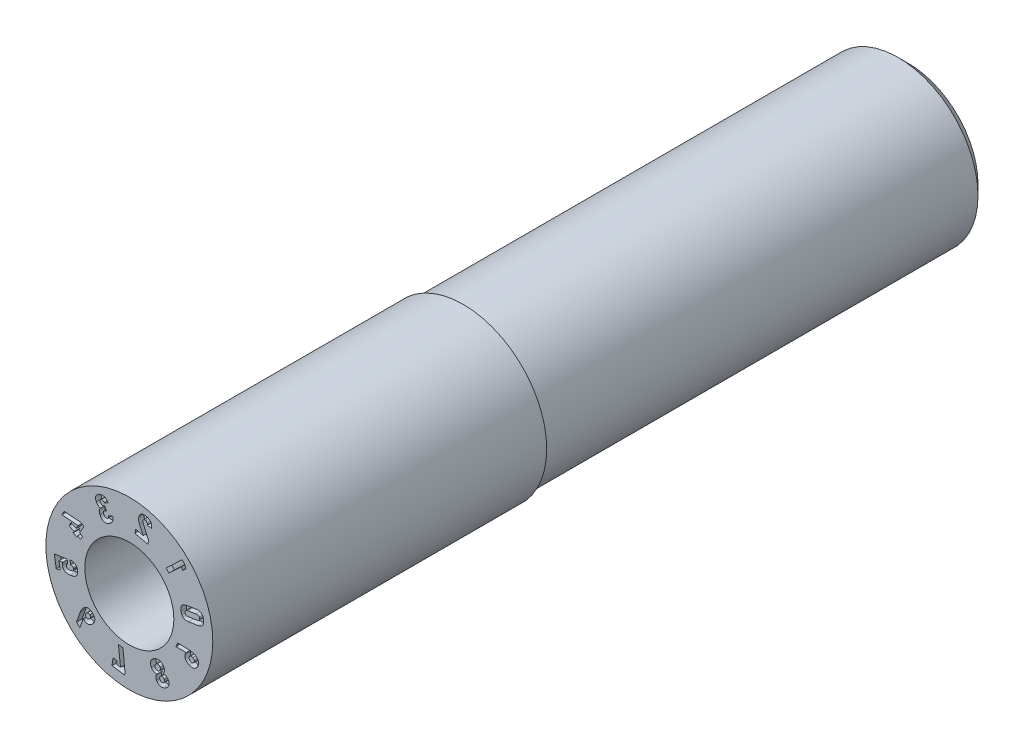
from build123d import *

# Parameters (mm, degrees)
SKETCH5_W          = 8
SKETCH5_H          = 1
CUT_EXTRUDE1_DEPTH = 0.1
CUT_EXTRUDE2_DEPTH = 1.4


with BuildPart() as part:
    # Sketch1 → Revolve1 (revolve)
    with BuildSketch(Plane(origin=(0, 0, 0), x_dir=(0, 0, -1), z_dir=(1, 0, 0)), mode=Mode.PRIVATE) as revolve1_sk:
        Polygon((0, 1.5), (0, 0.8), (2.2, 0.8), (2.2, 0.6), (11, 0.6), (11, 1), (14, 1), (14, 1.25), (13.75, 1.5), align=None)
    revolve(revolve1_sk.sketch.rotate(Axis((0, 0, 3.797909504), (0, 0, -1)), 90), axis=Axis((0, 0, 3.797909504), (0, 0, -1)))

    # Sketch5 → Cut-Revolve1 (revolve, cut)
    with BuildSketch(Plane(origin=(0, 0, 0), x_dir=(0, 0, -1), z_dir=(1, 0, 0)), mode=Mode.PRIVATE) as cut_revolve1_sk:
        with Locations((10, 1.935)):
            Rectangle(SKETCH5_W, SKETCH5_H)
    revolve(cut_revolve1_sk.sketch.rotate(Axis((0, 0, 0), (0, 0, -1)), 90), axis=Axis((0, 0, 0), (0, 0, -1)), mode=Mode.SUBTRACT)

    # Sketch2 → Cut-Extrude1 (cut)
    # profile 1 of 10: a face of its own
    with BuildSketch(Plane.XY):
        with BuildLine():
            Line((1.061105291, 0.091332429), (1.241310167, 0.120839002))
            add(Edge.make_bspline(
                [(1.241310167, 0.120839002), (1.249712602, 0.122329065), (1.261990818, 0.12503299), (1.277231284, 0.130894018), (1.287487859, 0.136007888), (1.296895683, 0.141888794), (1.305281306, 0.148745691), (1.312845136, 0.156329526), (1.319423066, 0.164756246), (1.325094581, 0.173946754), (1.329639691, 0.183906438), (1.333244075, 0.19451498), (1.33560567, 0.205869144), (1.33693586, 0.217888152), (1.337424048, 0.235376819), (1.335985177, 0.24880406), (1.334501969, 0.257897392)],
                knots=[0, 0, 0, 0, 0.135830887, 0.19894994, 0.259122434, 0.3177924, 0.374921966, 0.430943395, 0.487732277, 0.544476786, 0.602225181, 0.661404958, 0.72222515, 0.786185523, 0.85342678, 1, 1, 1, 1], degree=3))
            add(Edge.make_bspline(
                [(1.334501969, 0.257897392), (1.333078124, 0.267022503), (1.329955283, 0.280169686), (1.324067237, 0.296681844), (1.319025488, 0.307732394), (1.313005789, 0.317662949), (1.306406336, 0.326705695), (1.298850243, 0.334596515), (1.290629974, 0.341514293), (1.281752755, 0.347434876), (1.272130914, 0.352107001), (1.261996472, 0.355886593), (1.251203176, 0.358403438), (1.239856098, 0.360064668), (1.223455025, 0.360516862), (1.210887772, 0.359517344), (1.202412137, 0.358020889)],
                knots=[0, 0, 0, 0, 0.14661834, 0.213950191, 0.278189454, 0.339132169, 0.398086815, 0.455623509, 0.512166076, 0.568446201, 0.624592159, 0.681675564, 0.739860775, 0.800266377, 0.863502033, 1, 1, 1, 1], degree=3))
            Line((1.202412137, 0.358020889), (1.02220726, 0.328514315))
            add(Edge.make_bspline(
                [(1.02220726, 0.328514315), (1.013806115, 0.327021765), (1.001524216, 0.324324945), (0.986264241, 0.318443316), (0.975993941, 0.313354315), (0.966601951, 0.307444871), (0.958226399, 0.300583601), (0.950601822, 0.293025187), (0.944018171, 0.284569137), (0.938349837, 0.275379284), (0.93378897, 0.265442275), (0.930270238, 0.254795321), (0.927956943, 0.243428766), (0.926579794, 0.23139828), (0.92627547, 0.213913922), (0.927593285, 0.200499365), (0.929118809, 0.191404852)],
                knots=[0, 0, 0, 0, 0.135782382, 0.198878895, 0.259457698, 0.317687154, 0.374796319, 0.431184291, 0.487952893, 0.544677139, 0.602404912, 0.661302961, 0.722472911, 0.786410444, 0.853479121, 1, 1, 1, 1], degree=3))
            add(Edge.make_bspline(
                [(0.929118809, 0.191404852), (0.930653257, 0.182308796), (0.933505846, 0.169084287), (0.939548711, 0.152610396), (0.944717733, 0.141632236), (0.950575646, 0.131598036), (0.95730495, 0.122623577), (0.964929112, 0.114761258), (0.973221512, 0.107823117), (0.982275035, 0.10206596), (0.99184352, 0.097204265), (1.002059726, 0.09359919), (1.012790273, 0.090892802), (1.024119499, 0.089432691), (1.04032889, 0.08876663), (1.05273824, 0.089975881), (1.061105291, 0.091332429)],
                knots=[0, 0, 0, 0, 0.146857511, 0.214297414, 0.2786784, 0.339619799, 0.398794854, 0.456598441, 0.513449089, 0.570345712, 0.6268801, 0.683776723, 0.742278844, 0.802579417, 0.865100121, 1, 1, 1, 1], degree=3))
        make_face()
        with BuildLine():
            Line((1.053578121, 0.256946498), (1.19560905, 0.280242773))
            add(Edge.make_bspline(
                [(1.19560905, 0.280242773), (1.204155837, 0.28164808), (1.216530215, 0.282603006), (1.2320395, 0.280524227), (1.240103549, 0.277751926), (1.245724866, 0.274766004), (1.249446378, 0.272026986), (1.25266463, 0.268768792), (1.255612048, 0.265177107), (1.257860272, 0.260981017), (1.260795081, 0.254815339), (1.261815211, 0.249600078), (1.262507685, 0.246090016)],
                knots=[0, 0, 0, 0, 0.304004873, 0.431403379, 0.54612764, 0.60073158, 0.654116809, 0.707374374, 0.761014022, 0.816319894, 0.87376701, 1, 1, 1, 1], degree=3))
            add(Edge.make_bspline(
                [(1.262507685, 0.246090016), (1.263038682, 0.24257159), (1.263578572, 0.237314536), (1.262894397, 0.230529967), (1.262015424, 0.225834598), (1.26043404, 0.221496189), (1.258305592, 0.21746932), (1.255668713, 0.213719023), (1.251398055, 0.208991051), (1.244607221, 0.203810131), (1.230629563, 0.196786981), (1.218578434, 0.193739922), (1.210016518, 0.192432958)],
                knots=[0, 0, 0, 0, 0.125282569, 0.183772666, 0.238900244, 0.292522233, 0.345142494, 0.398364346, 0.453019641, 0.568244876, 0.695575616, 1, 1, 1, 1], degree=3))
            Line((1.210016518, 0.192432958), (1.067985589, 0.169136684))
            add(Edge.make_bspline(
                [(1.067985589, 0.169136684), (1.059415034, 0.167701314), (1.047014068, 0.166755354), (1.031460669, 0.168821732), (1.023401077, 0.171632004), (1.017834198, 0.174713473), (1.014150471, 0.177421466), (1.010897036, 0.180615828), (1.008012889, 0.184226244), (1.005608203, 0.188338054), (1.002904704, 0.194586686), (1.001736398, 0.199701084), (1.001113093, 0.203212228)],
                knots=[0, 0, 0, 0, 0.305186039, 0.43268909, 0.548095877, 0.602100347, 0.655529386, 0.707979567, 0.761663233, 0.817203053, 0.874610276, 1, 1, 1, 1], degree=3))
            add(Edge.make_bspline(
                [(1.001113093, 0.203212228), (1.000576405, 0.206752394), (0.999982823, 0.212016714), (1.000739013, 0.218795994), (1.001614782, 0.22348779), (1.003173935, 0.227849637), (1.005152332, 0.231979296), (1.007831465, 0.235707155), (1.01208896, 0.240439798), (1.018870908, 0.245640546), (1.032955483, 0.252499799), (1.044966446, 0.255680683), (1.053578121, 0.256946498)],
                knots=[0, 0, 0, 0, 0.126012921, 0.18354079, 0.238579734, 0.292863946, 0.345382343, 0.398518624, 0.453086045, 0.568126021, 0.695112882, 1, 1, 1, 1], degree=3))
        make_face(mode=Mode.SUBTRACT)
    # profile 2 of 10: a face of its own
    with BuildSketch(Plane.XY):
        Polygon((0.660301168, 0.727846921), (0.711724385, 0.673304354), (0.936972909, 0.885696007), (0.956782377, 0.838023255), (1.014689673, 0.892601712), (0.993469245, 0.954153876), (0.949588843, 1.000671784), align=None)
    # profile 3 of 10: a face of its own
    with BuildSketch(Plane.XY):
        with BuildLine():
            Line((0.345813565, 0.998950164), (0.253704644, 1.205895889))
            add(Edge.make_bspline(
                [(0.253704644, 1.205895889), (0.249756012, 1.214591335), (0.246068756, 1.226001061), (0.244672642, 1.239840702), (0.244243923, 1.24800905), (0.245135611, 1.253934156), (0.245888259, 1.257685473)],
                knots=[0, 0, 0, 0, 0.539847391, 0.665182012, 0.783746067, 1, 1, 1, 1], degree=3))
            add(Edge.make_bspline(
                [(0.245888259, 1.257685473), (0.247213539, 1.262849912), (0.249676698, 1.269823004), (0.256251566, 1.276593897), (0.261908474, 1.280382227), (0.268556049, 1.282767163), (0.27898945, 1.284480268), (0.287251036, 1.282983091), (0.292801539, 1.281861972)],
                knots=[0, 0, 0, 0, 0.246554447, 0.358339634, 0.470643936, 0.586937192, 0.711616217, 1, 1, 1, 1], degree=3))
            add(Edge.make_bspline(
                [(0.292801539, 1.281861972), (0.298416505, 1.280624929), (0.306338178, 1.277254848), (0.314903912, 1.269924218), (0.319690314, 1.263094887), (0.323238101, 1.255250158), (0.326165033, 1.242834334), (0.326041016, 1.232860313), (0.325122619, 1.226067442)],
                knots=[0, 0, 0, 0, 0.240641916, 0.353618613, 0.468242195, 0.587235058, 0.712493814, 1, 1, 1, 1], degree=3))
            Line((0.325122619, 1.226067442), (0.400214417, 1.208076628))
            add(Edge.make_bspline(
                [(0.400214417, 1.208076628), (0.402182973, 1.219927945), (0.403512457, 1.237158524), (0.401431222, 1.259553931), (0.397813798, 1.274920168), (0.392614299, 1.289294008), (0.38547612, 1.302404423), (0.376737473, 1.314303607), (0.36629261, 1.324876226), (0.354347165, 1.33415127), (0.335942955, 1.344543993), (0.32069766, 1.349934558), (0.310034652, 1.352322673)],
                knots=[0, 0, 0, 0, 0.185769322, 0.271412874, 0.354359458, 0.434537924, 0.512194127, 0.589378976, 0.667037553, 0.74626446, 0.827541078, 1, 1, 1, 1], degree=3))
            add(Edge.make_bspline(
                [(0.310034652, 1.352322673), (0.298767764, 1.355023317), (0.282009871, 1.357701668), (0.260116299, 1.357402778), (0.245219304, 1.355461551), (0.231405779, 1.351742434), (0.218764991, 1.346229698), (0.207313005, 1.339000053), (0.197223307, 1.329908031), (0.18843772, 1.319246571), (0.178362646, 1.30242038), (0.173478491, 1.288120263), (0.17112035, 1.278155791)],
                knots=[0, 0, 0, 0, 0.194556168, 0.282839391, 0.366540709, 0.445965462, 0.522017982, 0.597070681, 0.672156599, 0.74889867, 0.828020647, 1, 1, 1, 1], degree=3))
            add(Edge.make_bspline(
                [(0.17112035, 1.278155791), (0.168994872, 1.268991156), (0.166958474, 1.255425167), (0.166752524, 1.237062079), (0.167648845, 1.223122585), (0.169805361, 1.209272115), (0.173826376, 1.19118304), (0.178710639, 1.178173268), (0.182568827, 1.169830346)],
                knots=[0, 0, 0, 0, 0.246193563, 0.370512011, 0.497719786, 0.624739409, 0.750481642, 1, 1, 1, 1], degree=3))
            Line((0.182568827, 1.169830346), (0.249853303, 1.026420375))
            Line((0.249853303, 1.026420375), (0.116920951, 1.057728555))
            Line((0.116920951, 1.057728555), (0.100271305, 0.987159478))
            Line((0.100271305, 0.987159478), (0.330249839, 0.932939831))
            Line((0.330249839, 0.932939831), (0.345813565, 0.998950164))
        make_face()
    # profile 4 of 10: a face of its own
    with BuildSketch(Plane.XY):
        with BuildLine():
            Line((-0.30079773, 1.056129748), (-0.372170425, 1.025177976))
            add(Edge.make_bspline(
                [(-0.372170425, 1.025177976), (-0.371130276, 1.021378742), (-0.37001851, 1.015691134), (-0.369931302, 1.008181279), (-0.370410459, 1.002947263), (-0.37157798, 0.997985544), (-0.37331833, 0.993348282), (-0.375655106, 0.98903646), (-0.378495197, 0.985022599), (-0.381924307, 0.981361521), (-0.387322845, 0.97690902), (-0.392019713, 0.974319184), (-0.395340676, 0.972875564)],
                knots=[0, 0, 0, 0, 0.187325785, 0.273109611, 0.355951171, 0.436293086, 0.514407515, 0.59045926, 0.668563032, 0.747271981, 0.827934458, 1, 1, 1, 1], degree=3))
            add(Edge.make_bspline(
                [(-0.395340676, 0.972875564), (-0.401251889, 0.970350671), (-0.410351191, 0.967613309), (-0.422498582, 0.968024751), (-0.43064163, 0.970266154), (-0.43806197, 0.97439101), (-0.447211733, 0.982555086), (-0.452090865, 0.990814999), (-0.454647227, 0.99678484)],
                knots=[0, 0, 0, 0, 0.26670514, 0.383629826, 0.497523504, 0.612061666, 0.731013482, 1, 1, 1, 1], degree=3))
            Line((-0.454647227, 0.99678484), (-0.458345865, 1.00536625))
            add(Edge.make_bspline(
                [(-0.458345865, 1.00536625), (-0.461094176, 1.011585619), (-0.464129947, 1.02091581), (-0.465031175, 1.033335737), (-0.463955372, 1.041397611), (-0.461287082, 1.048655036), (-0.455327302, 1.057176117), (-0.448640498, 1.061620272), (-0.443745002, 1.06365982)],
                knots=[0, 0, 0, 0, 0.300448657, 0.427636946, 0.54636436, 0.656555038, 0.76555918, 1, 1, 1, 1], degree=3))
            Line((-0.443745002, 1.06365982), (-0.412776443, 1.077127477))
            Line((-0.412776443, 1.077127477), (-0.441658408, 1.143669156))
            Line((-0.441658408, 1.143669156), (-0.472626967, 1.130201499))
            add(Edge.make_bspline(
                [(-0.472626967, 1.130201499), (-0.476613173, 1.128453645), (-0.483084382, 1.126954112), (-0.491623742, 1.128451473), (-0.497546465, 1.131247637), (-0.503107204, 1.135486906), (-0.510272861, 1.143390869), (-0.514269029, 1.150806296), (-0.516546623, 1.156140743)],
                knots=[0, 0, 0, 0, 0.227938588, 0.33443529, 0.446444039, 0.566137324, 0.696860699, 1, 1, 1, 1], degree=3))
            Line((-0.516546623, 1.156140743), (-0.519303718, 1.162505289))
            add(Edge.make_bspline(
                [(-0.519303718, 1.162505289), (-0.5215372, 1.167515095), (-0.523942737, 1.175124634), (-0.524206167, 1.185276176), (-0.522956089, 1.191966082), (-0.52027999, 1.198018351), (-0.514755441, 1.205310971), (-0.508644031, 1.208957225), (-0.504361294, 1.210890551)],
                knots=[0, 0, 0, 0, 0.287321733, 0.409765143, 0.527101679, 0.639753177, 0.752440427, 1, 1, 1, 1], degree=3))
            add(Edge.make_bspline(
                [(-0.504361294, 1.210890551), (-0.501348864, 1.212169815), (-0.496635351, 1.213564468), (-0.490130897, 1.214052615), (-0.485268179, 1.213601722), (-0.480381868, 1.212552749), (-0.475552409, 1.210814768), (-0.470789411, 1.208366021), (-0.466070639, 1.205341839), (-0.461605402, 1.201508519), (-0.455517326, 1.195614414), (-0.451688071, 1.190298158), (-0.449194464, 1.186607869)],
                knots=[0, 0, 0, 0, 0.149128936, 0.221829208, 0.295876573, 0.370818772, 0.449003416, 0.528923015, 0.614401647, 0.703668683, 0.796545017, 1, 1, 1, 1], degree=3))
            Line((-0.449194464, 1.186607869), (-0.378107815, 1.217492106))
            add(Edge.make_bspline(
                [(-0.378107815, 1.217492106), (-0.383573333, 1.227699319), (-0.393151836, 1.241826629), (-0.408552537, 1.257887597), (-0.420900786, 1.267693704), (-0.433966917, 1.275711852), (-0.447668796, 1.281739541), (-0.461853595, 1.285924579), (-0.476522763, 1.287872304), (-0.491427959, 1.288086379), (-0.511697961, 1.2856743), (-0.526537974, 1.281167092), (-0.536052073, 1.27693168)],
                knots=[0, 0, 0, 0, 0.185488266, 0.271824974, 0.355693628, 0.437514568, 0.516845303, 0.594943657, 0.673717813, 0.753251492, 0.833268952, 1, 1, 1, 1], degree=3))
            add(Edge.make_bspline(
                [(-0.536052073, 1.27693168), (-0.543699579, 1.273528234), (-0.554684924, 1.268081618), (-0.567961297, 1.259236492), (-0.576488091, 1.252173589), (-0.584175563, 1.244793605), (-0.59069725, 1.236819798), (-0.596230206, 1.228376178), (-0.600740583, 1.219510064), (-0.604103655, 1.210221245), (-0.606480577, 1.200636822), (-0.607610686, 1.190733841), (-0.607658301, 1.180541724), (-0.606581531, 1.170066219), (-0.603586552, 1.155352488), (-0.59974615, 1.14447066), (-0.59658399, 1.137290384)],
                knots=[0, 0, 0, 0, 0.145099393, 0.211783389, 0.275893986, 0.336683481, 0.396114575, 0.453924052, 0.511277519, 0.568019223, 0.624714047, 0.681957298, 0.740253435, 0.800964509, 0.8640578, 1, 1, 1, 1], degree=3))
            Line((-0.59658399, 1.137290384), (-0.591761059, 1.126210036))
            add(Edge.make_bspline(
                [(-0.591761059, 1.126210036), (-0.588275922, 1.118204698), (-0.581741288, 1.106844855), (-0.56973817, 1.094648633), (-0.559797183, 1.087115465), (-0.548765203, 1.081297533), (-0.532538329, 1.075892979), (-0.519561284, 1.074544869), (-0.510806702, 1.074959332)],
                knots=[0, 0, 0, 0, 0.256823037, 0.378945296, 0.500019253, 0.621491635, 0.743175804, 1, 1, 1, 1], degree=3))
            add(Edge.make_bspline(
                [(-0.510806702, 1.074959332), (-0.514642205, 1.072113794), (-0.520103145, 1.067542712), (-0.526088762, 1.060382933), (-0.530049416, 1.054884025), (-0.533369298, 1.04899411), (-0.536199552, 1.042808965), (-0.538227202, 1.036220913), (-0.539796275, 1.029425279), (-0.54078901, 1.022367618), (-0.541052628, 1.015099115), (-0.540915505, 1.007620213), (-0.539953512, 1.000002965), (-0.538505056, 0.992195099), (-0.535443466, 0.981392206), (-0.532546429, 0.973295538), (-0.530187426, 0.967938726)],
                knots=[0, 0, 0, 0, 0.121200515, 0.179079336, 0.236021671, 0.292613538, 0.350073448, 0.407952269, 0.466857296, 0.526624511, 0.588137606, 0.650919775, 0.715867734, 0.78235817, 0.851885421, 1, 1, 1, 1], degree=3))
            Line((-0.530187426, 0.967938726), (-0.525420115, 0.956798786))
            add(Edge.make_bspline(
                [(-0.525420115, 0.956798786), (-0.521083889, 0.946850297), (-0.513481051, 0.932769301), (-0.500085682, 0.916991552), (-0.489339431, 0.907340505), (-0.477586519, 0.899632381), (-0.464944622, 0.893838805), (-0.451345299, 0.890319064), (-0.437027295, 0.888587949), (-0.421960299, 0.888997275), (-0.400377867, 0.892378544), (-0.384356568, 0.89785049), (-0.373764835, 0.902448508)],
                knots=[0, 0, 0, 0, 0.17807367, 0.259615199, 0.337969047, 0.413847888, 0.489006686, 0.564669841, 0.643008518, 0.724525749, 0.81071921, 1, 1, 1, 1], degree=3))
            add(Edge.make_bspline(
                [(-0.373764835, 0.902448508), (-0.363190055, 0.90696375), (-0.348311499, 0.915164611), (-0.330871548, 0.928861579), (-0.319668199, 0.939968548), (-0.310219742, 0.952077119), (-0.302669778, 0.965105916), (-0.297037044, 0.978962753), (-0.293396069, 0.99356865), (-0.291703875, 1.008765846), (-0.292818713, 1.030053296), (-0.296801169, 1.0458668), (-0.30079773, 1.056129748)],
                knots=[0, 0, 0, 0, 0.181387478, 0.266397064, 0.349196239, 0.429699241, 0.508011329, 0.586041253, 0.664911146, 0.744826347, 0.826380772, 1, 1, 1, 1], degree=3))
        make_face()
    # profile 5 of 10: a face of its own
    with BuildSketch(Plane.XY):
        Polygon((-0.876360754, 0.671912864), (-1.170315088, 0.694570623), (-1.211535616, 0.620249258), (-0.922120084, 0.596399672), (-0.957342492, 0.532918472), (-1.045539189, 0.581823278), (-1.081963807, 0.516150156), (-0.993777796, 0.467251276), (-1.008923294, 0.439954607), (-0.945606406, 0.404848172), (-0.930460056, 0.432141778), (-0.876762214, 0.402366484), (-0.840337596, 0.468039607), (-0.894020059, 0.497806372), (-0.815978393, 0.638436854), align=None)
    # profile 6 of 10: a face of its own
    with BuildSketch(Plane.XY):
        with BuildLine():
            Line((-1.065974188, -0.006087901), (-1.05494176, -0.0807829))
            add(Edge.make_bspline(
                [(-1.05494176, -0.0807829), (-1.047918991, -0.080465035), (-1.03810682, -0.080939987), (-1.026101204, -0.084664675), (-1.018563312, -0.088720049), (-1.012247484, -0.093970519), (-1.005410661, -0.102691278), (-1.002920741, -0.110834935), (-1.002068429, -0.116362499)],
                knots=[0, 0, 0, 0, 0.285793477, 0.412921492, 0.53239847, 0.647955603, 0.760370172, 1, 1, 1, 1], degree=3))
            add(Edge.make_bspline(
                [(-1.002068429, -0.116362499), (-1.001144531, -0.122240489), (-1.001102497, -0.131233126), (-1.005374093, -0.142000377), (-1.010211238, -0.148860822), (-1.016607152, -0.154787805), (-1.027997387, -0.161199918), (-1.037889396, -0.163884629), (-1.044912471, -0.164843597)],
                knots=[0, 0, 0, 0, 0.244925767, 0.356384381, 0.468896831, 0.585751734, 0.710067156, 1, 1, 1, 1], degree=3))
            Line((-1.044912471, -0.164843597), (-1.078165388, -0.169934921))
            add(Edge.make_bspline(
                [(-1.078165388, -0.169934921), (-1.085135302, -0.171091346), (-1.095317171, -0.171569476), (-1.108035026, -0.169270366), (-1.115821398, -0.166069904), (-1.12238343, -0.161625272), (-1.12914265, -0.153497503), (-1.131925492, -0.14590896), (-1.132600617, -0.140564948)],
                knots=[0, 0, 0, 0, 0.303139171, 0.433056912, 0.551453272, 0.662010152, 0.769650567, 1, 1, 1, 1], degree=3))
            add(Edge.make_bspline(
                [(-1.132600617, -0.140564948), (-1.13329294, -0.135553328), (-1.133675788, -0.127978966), (-1.131387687, -0.118400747), (-1.128795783, -0.111830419), (-1.1250072, -0.105899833), (-1.118531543, -0.098859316), (-1.112390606, -0.094888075), (-1.107972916, -0.092820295)],
                knots=[0, 0, 0, 0, 0.26314939, 0.385420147, 0.507310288, 0.627040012, 0.747387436, 1, 1, 1, 1], degree=3))
            Line((-1.107972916, -0.092820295), (-1.118583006, -0.023031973))
            Line((-1.118583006, -0.023031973), (-1.346539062, -0.05767993))
            Line((-1.346539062, -0.05767993), (-1.314208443, -0.27056081))
            Line((-1.314208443, -0.27056081), (-1.242222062, -0.259605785))
            Line((-1.242222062, -0.259605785), (-1.263184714, -0.121400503))
            Line((-1.263184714, -0.121400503), (-1.193162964, -0.110717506))
            add(Edge.make_bspline(
                [(-1.193162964, -0.110717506), (-1.19552954, -0.114165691), (-1.198495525, -0.120000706), (-1.201169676, -0.12857847), (-1.204304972, -0.143022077), (-1.204371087, -0.155660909), (-1.202945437, -0.165525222)],
                knots=[0, 0, 0, 0, 0.220510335, 0.343083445, 0.473505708, 1, 1, 1, 1], degree=3))
            add(Edge.make_bspline(
                [(-1.202945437, -0.165525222), (-1.201536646, -0.175151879), (-1.197736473, -0.189005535), (-1.189125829, -0.205634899), (-1.181013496, -0.216278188), (-1.171460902, -0.22551895), (-1.160362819, -0.233105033), (-1.147941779, -0.239249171), (-1.13404151, -0.243561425), (-1.118899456, -0.24650311), (-1.096245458, -0.247873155), (-1.078699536, -0.246639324), (-1.066773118, -0.244688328)],
                knots=[0, 0, 0, 0, 0.16345591, 0.239143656, 0.313391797, 0.387378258, 0.461556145, 0.538434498, 0.619394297, 0.705409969, 0.797083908, 1, 1, 1, 1], degree=3))
            Line((-1.066773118, -0.244688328), (-1.033520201, -0.239597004))
            add(Edge.make_bspline(
                [(-1.033520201, -0.239597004), (-1.021629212, -0.237682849), (-1.00433669, -0.233797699), (-0.983464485, -0.224439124), (-0.969924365, -0.216236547), (-0.958182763, -0.206585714), (-0.948212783, -0.195610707), (-0.940185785, -0.183255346), (-0.934051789, -0.169604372), (-0.92983302, -0.154776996), (-0.92694118, -0.132812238), (-0.92798305, -0.115725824), (-0.929775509, -0.104201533)],
                knots=[0, 0, 0, 0, 0.186829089, 0.271958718, 0.353046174, 0.4311405, 0.506366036, 0.581642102, 0.658195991, 0.737161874, 0.819375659, 1, 1, 1, 1], degree=3))
            add(Edge.make_bspline(
                [(-0.929775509, -0.104201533), (-0.931199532, -0.093987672), (-0.935271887, -0.079205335), (-0.944007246, -0.061018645), (-0.952215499, -0.048799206), (-0.961889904, -0.037806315), (-0.973073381, -0.02825315), (-0.985732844, -0.020306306), (-0.999677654, -0.013868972), (-1.014803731, -0.009065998), (-1.036984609, -0.005177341), (-1.05428196, -0.005037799), (-1.065974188, -0.006087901)],
                knots=[0, 0, 0, 0, 0.165214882, 0.244126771, 0.322749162, 0.400604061, 0.478371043, 0.557852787, 0.639634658, 0.724164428, 0.81171006, 1, 1, 1, 1], degree=3))
        make_face()
    # profile 7 of 10: a face of its own
    with BuildSketch(Plane.XY):
        with BuildLine():
            Line((-0.885086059, -0.73813894), (-0.947990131, -0.917865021))
            Line((-0.947990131, -0.917865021), (-0.887270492, -0.977544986))
            Line((-0.887270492, -0.977544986), (-0.828853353, -0.805452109))
            add(Edge.make_bspline(
                [(-0.828853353, -0.805452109), (-0.826109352, -0.809529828), (-0.822899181, -0.813294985), (-0.819389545, -0.81672828)],
                knots=[0.757127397, 0.757127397, 0.757127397, 0.757127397, 1, 1, 1, 1], degree=3))
            add(Edge.make_bspline(
                [(-0.819389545, -0.81672828), (-0.812103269, -0.823996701), (-0.80025814, -0.833469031), (-0.782687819, -0.842267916), (-0.769544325, -0.846602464), (-0.756102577, -0.84875298), (-0.74248347, -0.848756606), (-0.728752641, -0.846587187), (-0.71499641, -0.842268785), (-0.701230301, -0.835945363), (-0.682548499, -0.824199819), (-0.669589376, -0.813064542), (-0.661434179, -0.804679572)],
                knots=[0, 0, 0, 0, 0.171793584, 0.250451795, 0.326709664, 0.401750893, 0.476550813, 0.552959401, 0.632714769, 0.716336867, 0.80495314, 1, 1, 1, 1], degree=3))
            add(Edge.make_bspline(
                [(-0.661434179, -0.804679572), (-0.652790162, -0.795907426), (-0.641584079, -0.78238381), (-0.630332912, -0.762659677), (-0.624512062, -0.748057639), (-0.620713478, -0.733423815), (-0.619459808, -0.718729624), (-0.620300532, -0.704127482), (-0.623702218, -0.68969541), (-0.629191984, -0.675458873), (-0.639910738, -0.656294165), (-0.650935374, -0.643400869), (-0.659169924, -0.635305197)],
                knots=[0, 0, 0, 0, 0.186781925, 0.272275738, 0.353204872, 0.431350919, 0.5072304, 0.582333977, 0.658567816, 0.737552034, 0.819660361, 1, 1, 1, 1], degree=3))
            add(Edge.make_bspline(
                [(-0.659169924, -0.635305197), (-0.667326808, -0.627275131), (-0.680298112, -0.616510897), (-0.699522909, -0.606173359), (-0.713816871, -0.600931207), (-0.728240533, -0.597734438), (-0.742788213, -0.59692107), (-0.757343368, -0.598420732), (-0.771818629, -0.602265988), (-0.786158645, -0.60829494), (-0.80554806, -0.619666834), (-0.818801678, -0.630928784), (-0.827046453, -0.639455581)],
                knots=[0, 0, 0, 0, 0.180099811, 0.262678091, 0.341899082, 0.418650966, 0.494011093, 0.569864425, 0.647645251, 0.7285268, 0.813593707, 1, 1, 1, 1], degree=3))
            add(Edge.make_bspline(
                [(-0.827046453, -0.639455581), (-0.832442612, -0.64510175), (-0.839985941, -0.653630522), (-0.849086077, -0.666096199), (-0.862952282, -0.686869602), (-0.872307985, -0.705884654), (-0.878852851, -0.721561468)],
                knots=[0, 0, 0, 0, 0.230217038, 0.350353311, 0.475606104, 1, 1, 1, 1], degree=3))
            add(Edge.make_bspline(
                [(-0.878852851, -0.721561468), (-0.879945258, -0.724374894), (-0.882403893, -0.729754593), (-0.884234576, -0.735380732), (-0.885086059, -0.73813894)],
                knots=[0, 0, 0, 0, 0.511008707, 1, 1, 1, 1], degree=3))
        make_face()
        with BuildLine():
            add(Edge.make_bspline(
                [(-0.710037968, -0.687066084), (-0.705799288, -0.69130701), (-0.700131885, -0.698268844), (-0.69656589, -0.709165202), (-0.695810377, -0.717193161), (-0.697072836, -0.725246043), (-0.701197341, -0.736454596), (-0.707247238, -0.743672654), (-0.711578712, -0.748320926)],
                knots=[0, 0, 0, 0, 0.260460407, 0.375583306, 0.489396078, 0.604447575, 0.723759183, 1, 1, 1, 1], degree=3))
            add(Edge.make_bspline(
                [(-0.711578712, -0.748320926), (-0.716992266, -0.753779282), (-0.725127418, -0.76065851), (-0.737388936, -0.766382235), (-0.746109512, -0.768382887), (-0.75469635, -0.768439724), (-0.766064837, -0.765455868), (-0.773446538, -0.760174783), (-0.777729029, -0.755915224)],
                knots=[0, 0, 0, 0, 0.29377292, 0.419014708, 0.536353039, 0.648012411, 0.758188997, 1, 1, 1, 1], degree=3))
            add(Edge.make_bspline(
                [(-0.777729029, -0.755915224), (-0.782042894, -0.751775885), (-0.787304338, -0.744467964), (-0.790296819, -0.733182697), (-0.790428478, -0.724568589), (-0.788413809, -0.71578285), (-0.783008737, -0.703365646), (-0.776117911, -0.695185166), (-0.771053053, -0.689923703)],
                knots=[0, 0, 0, 0, 0.239543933, 0.349077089, 0.461979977, 0.58021125, 0.706533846, 1, 1, 1, 1], degree=3))
            add(Edge.make_bspline(
                [(-0.771053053, -0.689923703), (-0.766415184, -0.685158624), (-0.759143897, -0.67928186), (-0.748103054, -0.674715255), (-0.740074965, -0.673515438), (-0.732092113, -0.674115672), (-0.721267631, -0.677519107), (-0.714347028, -0.683043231), (-0.710037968, -0.687066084)],
                knots=[0, 0, 0, 0, 0.278664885, 0.398235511, 0.513421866, 0.626905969, 0.742284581, 1, 1, 1, 1], degree=3))
        make_face(mode=Mode.SUBTRACT)
    # profile 8 of 10: a face of its own
    with BuildSketch(Plane.XY):
        Polygon((-0.077737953, -1.262493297), (-0.114821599, -0.902628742), (-0.19583472, -0.890551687), (-0.158073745, -1.22770539), (-0.226194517, -1.217498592), (-0.217280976, -1.157845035), (-0.291949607, -1.146757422), (-0.31163715, -1.27836352), (-0.085142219, -1.312126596), align=None)
    # profile 9 of 10: a face of its own
    with BuildSketch(Plane.XY):
        with BuildLine():
            Line((0.392201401, -0.946296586), (0.395382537, -0.952038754))
            add(Edge.make_bspline(
                [(0.395382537, -0.952038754), (0.400084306, -0.960713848), (0.408995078, -0.972746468), (0.424079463, -0.985847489), (0.436808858, -0.994138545), (0.450549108, -1.000711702), (0.469711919, -1.006859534), (0.484778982, -1.008273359), (0.494753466, -1.007777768)],
                knots=[0, 0, 0, 0, 0.246724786, 0.370360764, 0.498167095, 0.625660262, 0.750332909, 1, 1, 1, 1], degree=3))
            add(Edge.make_bspline(
                [(0.494753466, -1.007777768), (0.48984174, -1.014761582), (0.483598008, -1.026051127), (0.478907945, -1.042436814), (0.47685025, -1.054953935), (0.476596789, -1.06747555), (0.478253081, -1.083671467), (0.482629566, -1.095062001), (0.486333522, -1.102097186)],
                knots=[0, 0, 0, 0, 0.257518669, 0.383851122, 0.511705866, 0.638421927, 0.759949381, 1, 1, 1, 1], degree=3))
            Line((0.486333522, -1.102097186), (0.491373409, -1.111271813))
            add(Edge.make_bspline(
                [(0.491373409, -1.111271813), (0.496036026, -1.120039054), (0.504577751, -1.132113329), (0.518830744, -1.145249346), (0.530524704, -1.153085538), (0.543156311, -1.159041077), (0.556492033, -1.163348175), (0.57058478, -1.16536646), (0.58520272, -1.165691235), (0.600223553, -1.163913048), (0.621148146, -1.159043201), (0.636245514, -1.152257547), (0.646098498, -1.146964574)],
                knots=[0, 0, 0, 0, 0.166668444, 0.245790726, 0.324267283, 0.402013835, 0.47959425, 0.558615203, 0.640144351, 0.724432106, 0.811864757, 1, 1, 1, 1], degree=3))
            add(Edge.make_bspline(
                [(0.646098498, -1.146964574), (0.655893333, -1.1415624), (0.669741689, -1.132545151), (0.685230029, -1.11766077), (0.694863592, -1.105999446), (0.702625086, -1.093608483), (0.708369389, -1.080625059), (0.71214526, -1.067186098), (0.713998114, -1.05336295), (0.713677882, -1.03931048), (0.71041035, -1.020208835), (0.704969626, -1.006438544), (0.70018567, -0.997715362)],
                knots=[0, 0, 0, 0, 0.188211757, 0.275462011, 0.360001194, 0.441724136, 0.520299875, 0.597693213, 0.675490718, 0.753735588, 0.832897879, 1, 1, 1, 1], degree=3))
            Line((0.70018567, -0.997715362), (0.695145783, -0.988540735))
            add(Edge.make_bspline(
                [(0.695145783, -0.988540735), (0.691342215, -0.981377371), (0.683803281, -0.971653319), (0.671183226, -0.961110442), (0.660335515, -0.95468575), (0.648657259, -0.949622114), (0.632193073, -0.945021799), (0.619322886, -0.944192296), (0.610780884, -0.944725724)],
                knots=[0, 0, 0, 0, 0.242008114, 0.364041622, 0.490138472, 0.61793056, 0.743948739, 1, 1, 1, 1], degree=3))
            add(Edge.make_bspline(
                [(0.610780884, -0.944725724), (0.61663228, -0.936481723), (0.623612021, -0.922936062), (0.629180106, -0.903420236), (0.631184, -0.888279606), (0.631331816, -0.87305737), (0.628550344, -0.853288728), (0.62350292, -0.839213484), (0.618709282, -0.830583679)],
                knots=[0, 0, 0, 0, 0.251613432, 0.37629348, 0.504150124, 0.63115011, 0.754560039, 1, 1, 1, 1], degree=3))
            Line((0.618709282, -0.830583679), (0.615528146, -0.824841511))
            add(Edge.make_bspline(
                [(0.615528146, -0.824841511), (0.610413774, -0.81565895), (0.60156147, -0.802682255), (0.586343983, -0.7888753), (0.573955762, -0.780559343), (0.560542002, -0.774264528), (0.546323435, -0.76986303), (0.531365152, -0.767697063), (0.515762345, -0.767501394), (0.499715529, -0.769431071), (0.477323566, -0.774701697), (0.461178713, -0.781972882), (0.450628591, -0.787623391)],
                knots=[0, 0, 0, 0, 0.166154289, 0.244772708, 0.322772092, 0.400586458, 0.477634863, 0.556648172, 0.638089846, 0.723022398, 0.810911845, 1, 1, 1, 1], degree=3))
            add(Edge.make_bspline(
                [(0.450628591, -0.787623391), (0.440108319, -0.793327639), (0.425407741, -0.803098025), (0.408726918, -0.818898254), (0.398409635, -0.831367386), (0.390046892, -0.844558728), (0.383711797, -0.858309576), (0.379754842, -0.87263749), (0.377698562, -0.887295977), (0.378007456, -0.902207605), (0.381154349, -0.92251469), (0.387313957, -0.937006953), (0.392201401, -0.946296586)],
                knots=[0, 0, 0, 0, 0.188837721, 0.276573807, 0.361580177, 0.443445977, 0.522303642, 0.599442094, 0.677093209, 0.7549534, 0.83386346, 1, 1, 1, 1], degree=3))
        make_face()
        with BuildLine():
            Line((0.554398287, -0.87065769), (0.55623279, -0.873977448))
            add(Edge.make_bspline(
                [(0.55623279, -0.873977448), (0.558255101, -0.877734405), (0.560626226, -0.883632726), (0.561994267, -0.891835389), (0.562120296, -0.897878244), (0.561291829, -0.90383386), (0.559461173, -0.909585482), (0.557073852, -0.915226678), (0.553648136, -0.920563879), (0.549521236, -0.925619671), (0.542798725, -0.932044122), (0.536823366, -0.935948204), (0.532566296, -0.938265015)],
                knots=[0, 0, 0, 0, 0.166320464, 0.244988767, 0.322776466, 0.400908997, 0.477958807, 0.557300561, 0.638801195, 0.724004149, 0.811028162, 1, 1, 1, 1], degree=3))
            add(Edge.make_bspline(
                [(0.532566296, -0.938265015), (0.528307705, -0.940589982), (0.5217823, -0.943515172), (0.512727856, -0.945603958), (0.5062393, -0.946385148), (0.499878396, -0.946300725), (0.493811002, -0.945273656), (0.488025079, -0.943537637), (0.482573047, -0.940996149), (0.477524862, -0.937624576), (0.471284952, -0.932023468), (0.467705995, -0.926690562), (0.465596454, -0.922958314)],
                knots=[0, 0, 0, 0, 0.188697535, 0.275242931, 0.359936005, 0.441904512, 0.52127938, 0.598081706, 0.675813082, 0.75388733, 0.832974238, 1, 1, 1, 1], degree=3))
            Line((0.465596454, -0.922958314), (0.463644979, -0.919368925))
            add(Edge.make_bspline(
                [(0.463644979, -0.919368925), (0.46149029, -0.91529104), (0.458707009, -0.908965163), (0.457185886, -0.900100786), (0.456830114, -0.89364814), (0.457401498, -0.887291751), (0.458971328, -0.881155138), (0.461271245, -0.875210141), (0.464646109, -0.869668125), (0.468698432, -0.864438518), (0.475214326, -0.857810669), (0.481192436, -0.853930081), (0.485384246, -0.851604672)],
                knots=[0, 0, 0, 0, 0.17344188, 0.255554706, 0.335790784, 0.415019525, 0.493571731, 0.572433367, 0.652914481, 0.735681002, 0.819936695, 1, 1, 1, 1], degree=3))
            add(Edge.make_bspline(
                [(0.485384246, -0.851604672), (0.489583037, -0.849253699), (0.496160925, -0.846531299), (0.505280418, -0.844648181), (0.511912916, -0.84410302), (0.518460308, -0.844338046), (0.524713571, -0.84576318), (0.530813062, -0.847706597), (0.536472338, -0.850772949), (0.54180543, -0.85456021), (0.548227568, -0.86092115), (0.552265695, -0.866517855), (0.554398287, -0.87065769)],
                knots=[0, 0, 0, 0, 0.179208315, 0.26295422, 0.345962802, 0.426693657, 0.505835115, 0.584150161, 0.664429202, 0.744497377, 0.827079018, 1, 1, 1, 1], degree=3))
        make_face(mode=Mode.SUBTRACT)
        with BuildLine():
            Line((0.627346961, -1.021995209), (0.629137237, -1.025383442))
            add(Edge.make_bspline(
                [(0.629137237, -1.025383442), (0.630956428, -1.028912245), (0.633389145, -1.034331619), (0.634812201, -1.041919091), (0.63520734, -1.04741681), (0.634751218, -1.052793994), (0.633553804, -1.057999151), (0.63159527, -1.062980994), (0.628914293, -1.067713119), (0.625559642, -1.072180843), (0.61992764, -1.077714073), (0.614927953, -1.081137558), (0.611298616, -1.083051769)],
                knots=[0, 0, 0, 0, 0.175695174, 0.258711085, 0.339200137, 0.417968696, 0.495636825, 0.573857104, 0.653052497, 0.734718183, 0.81929201, 1, 1, 1, 1], degree=3))
            add(Edge.make_bspline(
                [(0.611298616, -1.083051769), (0.607715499, -1.085005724), (0.602183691, -1.087479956), (0.594477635, -1.089030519), (0.588923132, -1.089468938), (0.583478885, -1.089168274), (0.578181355, -1.088134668), (0.573153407, -1.086215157), (0.56836967, -1.083615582), (0.56390113, -1.080328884), (0.558268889, -1.074955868), (0.554884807, -1.070034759), (0.553015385, -1.066465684)],
                knots=[0, 0, 0, 0, 0.17968622, 0.263222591, 0.344126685, 0.423753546, 0.501973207, 0.580147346, 0.659127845, 0.740409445, 0.823020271, 1, 1, 1, 1], degree=3))
            Line((0.553015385, -1.066465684), (0.55106391, -1.062876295))
            add(Edge.make_bspline(
                [(0.55106391, -1.062876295), (0.549024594, -1.059193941), (0.546646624, -1.053464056), (0.544873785, -1.04552589), (0.544508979, -1.039735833), (0.544691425, -1.034051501), (0.545818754, -1.028598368), (0.547578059, -1.02334952), (0.550231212, -1.018453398), (0.553453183, -1.013793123), (0.559072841, -1.008204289), (0.563961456, -1.004646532), (0.567600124, -1.002717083)],
                knots=[0, 0, 0, 0, 0.179693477, 0.26343513, 0.346335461, 0.42698558, 0.505681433, 0.583403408, 0.662662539, 0.742851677, 0.824597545, 1, 1, 1, 1], degree=3))
            add(Edge.make_bspline(
                [(0.567600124, -1.002717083), (0.571200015, -1.000763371), (0.57683185, -0.998402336), (0.584639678, -0.996970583), (0.590296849, -0.996686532), (0.595808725, -0.997226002), (0.601173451, -0.998522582), (0.606370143, -1.000595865), (0.611294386, -1.003542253), (0.615977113, -1.007110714), (0.621738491, -1.013033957), (0.625326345, -1.01822767), (0.627346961, -1.021995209)],
                knots=[0, 0, 0, 0, 0.174105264, 0.256517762, 0.335895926, 0.413793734, 0.490763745, 0.569485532, 0.650300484, 0.733636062, 0.818709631, 1, 1, 1, 1], degree=3))
        make_face(mode=Mode.SUBTRACT)
    # profile 10 of 10: a face of its own
    with BuildSketch(Plane.XY):
        with BuildLine():
            Line((1.056306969, -0.339743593), (0.871420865, -0.334504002))
            Line((0.871420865, -0.334504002), (0.83877799, -0.406910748))
            Line((0.83877799, -0.406910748), (1.021210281, -0.40901767))
            add(Edge.make_bspline(
                [(1.021210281, -0.40901767), (1.020977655, -0.409282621), (1.018969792, -0.411601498), (1.01346394, -0.418720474), (1.009431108, -0.426417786), (1.006961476, -0.431783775)],
                knots=[0.564285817, 0.564285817, 0.564285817, 0.564285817, 0.581373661, 0.712937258, 1, 1, 1, 1], degree=3))
            add(Edge.make_bspline(
                [(1.006961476, -0.431783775), (1.003053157, -0.440457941), (0.998718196, -0.453980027), (0.997147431, -0.472519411), (0.998045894, -0.486026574), (1.000936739, -0.499207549), (1.005793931, -0.511894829), (1.012446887, -0.524053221), (1.0211279, -0.535447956), (1.031304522, -0.546229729), (1.047772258, -0.559391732), (1.061790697, -0.567428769), (1.071858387, -0.571840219)],
                knots=[0, 0, 0, 0, 0.164632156, 0.242706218, 0.320407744, 0.397787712, 0.475087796, 0.554519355, 0.636517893, 0.722073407, 0.810186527, 1, 1, 1, 1], degree=3))
            add(Edge.make_bspline(
                [(1.071858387, -0.571840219), (1.083035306, -0.576836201), (1.09957739, -0.582826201), (1.122004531, -0.586464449), (1.137676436, -0.586887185), (1.152656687, -0.585222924), (1.166865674, -0.581536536), (1.180148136, -0.575484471), (1.192530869, -0.567482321), (1.204007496, -0.557485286), (1.218083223, -0.540759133), (1.226490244, -0.526122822), (1.231184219, -0.515595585)],
                knots=[0, 0, 0, 0, 0.187679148, 0.273085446, 0.354255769, 0.432047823, 0.508049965, 0.582768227, 0.659259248, 0.737860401, 0.819816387, 1, 1, 1, 1], degree=3))
            add(Edge.make_bspline(
                [(1.231184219, -0.515595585), (1.235930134, -0.505211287), (1.24132943, -0.489300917), (1.244333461, -0.467708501), (1.244078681, -0.45245235), (1.241870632, -0.437787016), (1.237358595, -0.423842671), (1.230646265, -0.41068575), (1.221886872, -0.3982774), (1.210947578, -0.386863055), (1.193151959, -0.372470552), (1.177651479, -0.363910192), (1.166630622, -0.358927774)],
                knots=[0, 0, 0, 0, 0.177917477, 0.259849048, 0.338517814, 0.414863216, 0.490140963, 0.565827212, 0.644192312, 0.725962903, 0.811370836, 1, 1, 1, 1], degree=3))
            add(Edge.make_bspline(
                [(1.166630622, -0.358927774), (1.160037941, -0.356040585), (1.150037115, -0.352245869), (1.135940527, -0.348593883), (1.124519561, -0.346116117), (1.112431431, -0.344203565), (1.095033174, -0.34200583), (1.081598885, -0.341039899), (1.072429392, -0.340518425)],
                knots=[0, 0, 0, 0, 0.216429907, 0.332452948, 0.453550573, 0.580519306, 0.713714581, 1, 1, 1, 1], degree=3))
            add(Edge.make_bspline(
                [(1.072429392, -0.340518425), (1.069753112, -0.340260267), (1.064386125, -0.339751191), (1.058997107, -0.339840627), (1.056306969, -0.339743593)],
                knots=[0, 0, 0, 0, 0.499821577, 1, 1, 1, 1], degree=3))
        make_face()
        with BuildLine():
            add(Edge.make_bspline(
                [(1.077327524, -0.446222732), (1.079717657, -0.440815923), (1.084576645, -0.433373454), (1.093815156, -0.426583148), (1.101488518, -0.423350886), (1.109997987, -0.422021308), (1.1228416, -0.422562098), (1.132446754, -0.425799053), (1.138776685, -0.428630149)],
                knots=[0, 0, 0, 0, 0.24585986, 0.357747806, 0.470577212, 0.587378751, 0.71157635, 1, 1, 1, 1], degree=3))
            add(Edge.make_bspline(
                [(1.138776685, -0.428630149), (1.145118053, -0.431623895), (1.153629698, -0.436415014), (1.162190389, -0.445425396), (1.16645764, -0.452621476), (1.168939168, -0.460401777), (1.169640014, -0.471774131), (1.167220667, -0.480263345), (1.164731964, -0.485634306)],
                knots=[0, 0, 0, 0, 0.284238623, 0.406222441, 0.522183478, 0.635477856, 0.748678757, 1, 1, 1, 1], degree=3))
            add(Edge.make_bspline(
                [(1.164731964, -0.485634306), (1.162217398, -0.491069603), (1.157575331, -0.498765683), (1.148424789, -0.505792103), (1.140878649, -0.509066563), (1.132596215, -0.510653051), (1.120089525, -0.510159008), (1.110797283, -0.5070315), (1.104660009, -0.504294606)],
                knots=[0, 0, 0, 0, 0.253207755, 0.366338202, 0.47881208, 0.595326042, 0.717101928, 1, 1, 1, 1], degree=3))
            add(Edge.make_bspline(
                [(1.104660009, -0.504294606), (1.098017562, -0.501448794), (1.089371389, -0.496276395), (1.080431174, -0.487075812), (1.075936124, -0.47975537), (1.073253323, -0.471873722), (1.072401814, -0.460326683), (1.074846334, -0.451692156), (1.077327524, -0.446222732)],
                knots=[0, 0, 0, 0, 0.286745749, 0.410302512, 0.526566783, 0.638732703, 0.750982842, 1, 1, 1, 1], degree=3))
        make_face(mode=Mode.SUBTRACT)
    extrude(amount=-CUT_EXTRUDE1_DEPTH, mode=Mode.SUBTRACT)

    # Sketch3 → Cut-Extrude2 (cut)
    with BuildSketch(Plane.XY.offset(-2.2)):
        Polygon((0.346410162, 0.6), (-0.346410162, 0.6), (-0.692820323, 0), (-0.346410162, -0.6), (0.346410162, -0.6), (0.692820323, 0), align=None)
    extrude(amount=-CUT_EXTRUDE2_DEPTH, mode=Mode.SUBTRACT)


solid = part.part
